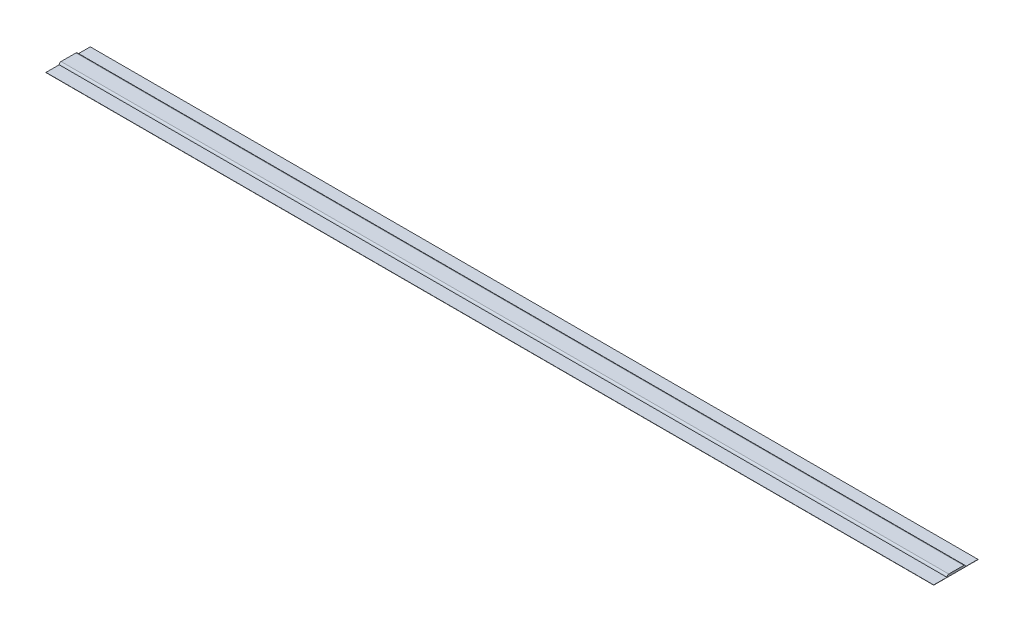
ISO-10303-21;
HEADER;
FILE_DESCRIPTION(('STEP AP214'),'2;1');
FILE_NAME('part.step','',(''),(''),'','','');
FILE_SCHEMA(('AUTOMOTIVE_DESIGN { 1 0 10303 214 1 1 1 1 }'));
ENDSEC;
DATA;
#1=APPLICATION_CONTEXT('core data for automotive mechanical design processes');
#2=APPLICATION_PROTOCOL_DEFINITION('international standard','automotive_design',2000,#1);
#3=PRODUCT_CONTEXT('',#1,'mechanical');
#4=PRODUCT('Part','Part','',(#3));
#5=PRODUCT_RELATED_PRODUCT_CATEGORY('part','',(#4));
#6=PRODUCT_DEFINITION_FORMATION('','',#4);
#7=PRODUCT_DEFINITION_CONTEXT('part definition',#1,'design');
#8=PRODUCT_DEFINITION('design','',#6,#7);
#9=PRODUCT_DEFINITION_SHAPE('','',#8);
#10=(LENGTH_UNIT() NAMED_UNIT(*) SI_UNIT(.MILLI.,.METRE.));
#11=(NAMED_UNIT(*) PLANE_ANGLE_UNIT() SI_UNIT($,.RADIAN.));
#12=(NAMED_UNIT(*) SI_UNIT($,.STERADIAN.) SOLID_ANGLE_UNIT());
#13=UNCERTAINTY_MEASURE_WITH_UNIT(LENGTH_MEASURE(1.E-05),#10,'distance_accuracy_value','');
#14=(GEOMETRIC_REPRESENTATION_CONTEXT(3) GLOBAL_UNCERTAINTY_ASSIGNED_CONTEXT((#13)) GLOBAL_UNIT_ASSIGNED_CONTEXT((#10,
#11,#12)) REPRESENTATION_CONTEXT('',''));
#15=CARTESIAN_POINT('',(0.,0.,0.));
#16=DIRECTION('',(0.,0.,1.));
#17=DIRECTION('',(1.,0.,0.));
#18=AXIS2_PLACEMENT_3D('',#15,#16,#17);
#19=CARTESIAN_POINT('',(-477.393,0.254,23.8125));
#20=DIRECTION('',(0.,1.,0.));
#21=DIRECTION('',(0.,0.,1.));
#22=AXIS2_PLACEMENT_3D('',#19,#20,#21);
#23=PLANE('',#22);
#24=DIRECTION('',(0.,0.,1.));
#25=VECTOR('',#24,1.);
#26=CARTESIAN_POINT('',(-477.393,0.254,-23.8125));
#27=LINE('',#26,#25);
#28=CARTESIAN_POINT('',(-477.393,0.254,-23.8125));
#29=VERTEX_POINT('',#28);
#30=CARTESIAN_POINT('',(-477.393,0.254,-10.412000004));
#31=VERTEX_POINT('',#30);
#32=EDGE_CURVE('E129',#29,#31,#27,.T.);
#33=ORIENTED_EDGE('',*,*,#32,.T.);
#34=DIRECTION('',(1.,0.,0.));
#35=VECTOR('',#34,1.);
#36=CARTESIAN_POINT('',(-477.393,0.254,-10.412000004));
#37=LINE('',#36,#35);
#38=CARTESIAN_POINT('',(477.393,0.254,-10.412000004));
#39=VERTEX_POINT('',#38);
#40=EDGE_CURVE('E117',#31,#39,#37,.T.);
#41=ORIENTED_EDGE('',*,*,#40,.T.);
#42=DIRECTION('',(0.,0.,-1.));
#43=VECTOR('',#42,1.);
#44=CARTESIAN_POINT('',(477.393,0.254,-23.8125));
#45=LINE('',#44,#43);
#46=CARTESIAN_POINT('',(477.393,0.254,-23.8125));
#47=VERTEX_POINT('',#46);
#48=EDGE_CURVE('E142',#39,#47,#45,.T.);
#49=ORIENTED_EDGE('',*,*,#48,.T.);
#50=DIRECTION('',(-1.,0.,0.));
#51=VECTOR('',#50,1.);
#52=CARTESIAN_POINT('',(-477.393,0.254,-23.8125));
#53=LINE('',#52,#51);
#54=EDGE_CURVE('E67',#47,#29,#53,.T.);
#55=ORIENTED_EDGE('',*,*,#54,.T.);
#56=EDGE_LOOP('',(#33,#41,#49,#55));
#57=FACE_BOUND('',#56,.T.);
#58=ADVANCED_FACE('F42',(#57),#23,.T.);
#59=CARTESIAN_POINT('',(-477.393,0.254,-23.8125));
#60=DIRECTION('',(1.,0.,0.));
#61=DIRECTION('',(0.,0.,-1.));
#62=AXIS2_PLACEMENT_3D('',#59,#60,#61);
#63=PLANE('',#62);
#64=DIRECTION('',(0.,0.,1.));
#65=VECTOR('',#64,1.);
#66=CARTESIAN_POINT('',(-477.393,0.,-23.8125));
#67=LINE('',#66,#65);
#68=CARTESIAN_POINT('',(-477.393,0.,-23.8125));
#69=VERTEX_POINT('',#68);
#70=CARTESIAN_POINT('',(-477.393,0.,23.8125));
#71=VERTEX_POINT('',#70);
#72=EDGE_CURVE('E153',#69,#71,#67,.T.);
#73=ORIENTED_EDGE('',*,*,#72,.T.);
#74=DIRECTION('',(0.,-1.,0.));
#75=VECTOR('',#74,1.);
#76=CARTESIAN_POINT('',(-477.393,0.254,23.8125));
#77=LINE('',#76,#75);
#78=CARTESIAN_POINT('',(-477.393,0.254,23.8125));
#79=VERTEX_POINT('',#78);
#80=EDGE_CURVE('E11',#79,#71,#77,.T.);
#81=ORIENTED_EDGE('',*,*,#80,.F.);
#82=CARTESIAN_POINT('',(-477.393,0.254,9.652));
#83=VERTEX_POINT('',#82);
#84=EDGE_CURVE('E96',#83,#79,#27,.T.);
#85=ORIENTED_EDGE('',*,*,#84,.F.);
#86=CARTESIAN_POINT('',(-477.393,0.254,7.62));
#87=DIRECTION('',(1.,0.,0.));
#88=DIRECTION('',(0.,0.,-1.));
#89=AXIS2_PLACEMENT_3D('',#86,#87,#88);
#90=CIRCLE('',#89,2.032);
#91=CARTESIAN_POINT('',(-477.393,2.286,7.62));
#92=VERTEX_POINT('',#91);
#93=EDGE_CURVE('E124',#92,#83,#90,.T.);
#94=ORIENTED_EDGE('',*,*,#93,.F.);
#95=DIRECTION('',(0.,0.,-1.));
#96=VECTOR('',#95,1.);
#97=CARTESIAN_POINT('',(-477.393,2.286,0.));
#98=LINE('',#97,#96);
#99=CARTESIAN_POINT('',(-477.393,2.286,-8.380000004));
#100=VERTEX_POINT('',#99);
#101=EDGE_CURVE('E132',#92,#100,#98,.T.);
#102=ORIENTED_EDGE('',*,*,#101,.T.);
#103=CARTESIAN_POINT('',(-477.393,0.254,-8.380000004));
#104=DIRECTION('',(1.,0.,0.));
#105=DIRECTION('',(0.,0.,-1.));
#106=AXIS2_PLACEMENT_3D('',#103,#104,#105);
#107=CIRCLE('',#106,2.032);
#108=EDGE_CURVE('E120',#31,#100,#107,.T.);
#109=ORIENTED_EDGE('',*,*,#108,.F.);
#110=ORIENTED_EDGE('',*,*,#32,.F.);
#111=DIRECTION('',(0.,-1.,0.));
#112=VECTOR('',#111,1.);
#113=CARTESIAN_POINT('',(-477.393,0.254,-23.8125));
#114=LINE('',#113,#112);
#115=EDGE_CURVE('E152',#29,#69,#114,.T.);
#116=ORIENTED_EDGE('',*,*,#115,.T.);
#117=EDGE_LOOP('',(#73,#81,#85,#94,#102,#109,#110,#116));
#118=FACE_BOUND('',#117,.T.);
#119=ADVANCED_FACE('F44',(#118),#63,.F.);
#120=CARTESIAN_POINT('',(-477.393,0.254,23.8125));
#121=DIRECTION('',(0.,0.,-1.));
#122=DIRECTION('',(-1.,0.,0.));
#123=AXIS2_PLACEMENT_3D('',#120,#121,#122);
#124=PLANE('',#123);
#125=DIRECTION('',(1.,0.,0.));
#126=VECTOR('',#125,1.);
#127=CARTESIAN_POINT('',(-477.393,0.,23.8125));
#128=LINE('',#127,#126);
#129=CARTESIAN_POINT('',(477.393,0.,23.8125));
#130=VERTEX_POINT('',#129);
#131=EDGE_CURVE('E156',#71,#130,#128,.T.);
#132=ORIENTED_EDGE('',*,*,#131,.T.);
#133=DIRECTION('',(0.,-1.,0.));
#134=VECTOR('',#133,1.);
#135=CARTESIAN_POINT('',(477.393,0.254,23.8125));
#136=LINE('',#135,#134);
#137=CARTESIAN_POINT('',(477.393,0.254,23.8125));
#138=VERTEX_POINT('',#137);
#139=EDGE_CURVE('E51',#138,#130,#136,.T.);
#140=ORIENTED_EDGE('',*,*,#139,.F.);
#141=DIRECTION('',(1.,0.,0.));
#142=VECTOR('',#141,1.);
#143=CARTESIAN_POINT('',(-477.393,0.254,23.8125));
#144=LINE('',#143,#142);
#145=EDGE_CURVE('E138',#79,#138,#144,.T.);
#146=ORIENTED_EDGE('',*,*,#145,.F.);
#147=ORIENTED_EDGE('',*,*,#80,.T.);
#148=EDGE_LOOP('',(#132,#140,#146,#147));
#149=FACE_BOUND('',#148,.T.);
#150=ADVANCED_FACE('F208',(#149),#124,.F.);
#151=CARTESIAN_POINT('',(477.393,0.254,-23.8125));
#152=DIRECTION('',(-1.,0.,0.));
#153=DIRECTION('',(0.,0.,1.));
#154=AXIS2_PLACEMENT_3D('',#151,#152,#153);
#155=PLANE('',#154);
#156=DIRECTION('',(0.,0.,-1.));
#157=VECTOR('',#156,1.);
#158=CARTESIAN_POINT('',(477.393,0.,-23.8125));
#159=LINE('',#158,#157);
#160=CARTESIAN_POINT('',(477.393,0.,-23.8125));
#161=VERTEX_POINT('',#160);
#162=EDGE_CURVE('E160',#130,#161,#159,.T.);
#163=ORIENTED_EDGE('',*,*,#162,.T.);
#164=DIRECTION('',(0.,-1.,0.));
#165=VECTOR('',#164,1.);
#166=CARTESIAN_POINT('',(477.393,0.254,-23.8125));
#167=LINE('',#166,#165);
#168=EDGE_CURVE('E167',#47,#161,#167,.T.);
#169=ORIENTED_EDGE('',*,*,#168,.F.);
#170=ORIENTED_EDGE('',*,*,#48,.F.);
#171=CARTESIAN_POINT('',(477.393,0.254,-8.380000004));
#172=DIRECTION('',(1.,0.,0.));
#173=DIRECTION('',(0.,0.,-1.));
#174=AXIS2_PLACEMENT_3D('',#171,#172,#173);
#175=CIRCLE('',#174,2.032);
#176=CARTESIAN_POINT('',(477.393,2.286,-8.380000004));
#177=VERTEX_POINT('',#176);
#178=EDGE_CURVE('E58',#39,#177,#175,.T.);
#179=ORIENTED_EDGE('',*,*,#178,.T.);
#180=DIRECTION('',(0.,0.,-1.));
#181=VECTOR('',#180,1.);
#182=CARTESIAN_POINT('',(477.393,2.286,0.));
#183=LINE('',#182,#181);
#184=CARTESIAN_POINT('',(477.393,2.286,7.62));
#185=VERTEX_POINT('',#184);
#186=EDGE_CURVE('E187',#185,#177,#183,.T.);
#187=ORIENTED_EDGE('',*,*,#186,.F.);
#188=CARTESIAN_POINT('',(477.393,0.254,7.62));
#189=DIRECTION('',(1.,0.,0.));
#190=DIRECTION('',(0.,0.,-1.));
#191=AXIS2_PLACEMENT_3D('',#188,#189,#190);
#192=CIRCLE('',#191,2.032);
#193=CARTESIAN_POINT('',(477.393,0.254,9.652));
#194=VERTEX_POINT('',#193);
#195=EDGE_CURVE('E135',#185,#194,#192,.T.);
#196=ORIENTED_EDGE('',*,*,#195,.T.);
#197=EDGE_CURVE('E146',#138,#194,#45,.T.);
#198=ORIENTED_EDGE('',*,*,#197,.F.);
#199=ORIENTED_EDGE('',*,*,#139,.T.);
#200=EDGE_LOOP('',(#163,#169,#170,#179,#187,#196,#198,#199));
#201=FACE_BOUND('',#200,.T.);
#202=ADVANCED_FACE('F175',(#201),#155,.F.);
#203=CARTESIAN_POINT('',(-477.393,0.254,-23.8125));
#204=DIRECTION('',(0.,0.,1.));
#205=DIRECTION('',(1.,0.,0.));
#206=AXIS2_PLACEMENT_3D('',#203,#204,#205);
#207=PLANE('',#206);
#208=DIRECTION('',(-1.,0.,0.));
#209=VECTOR('',#208,1.);
#210=CARTESIAN_POINT('',(-477.393,0.,-23.8125));
#211=LINE('',#210,#209);
#212=EDGE_CURVE('E88',#161,#69,#211,.T.);
#213=ORIENTED_EDGE('',*,*,#212,.T.);
#214=ORIENTED_EDGE('',*,*,#115,.F.);
#215=ORIENTED_EDGE('',*,*,#54,.F.);
#216=ORIENTED_EDGE('',*,*,#168,.T.);
#217=EDGE_LOOP('',(#213,#214,#215,#216));
#218=FACE_BOUND('',#217,.T.);
#219=ADVANCED_FACE('F183',(#218),#207,.F.);
#220=DIRECTION('',(1.,0.,0.));
#221=VECTOR('',#220,1.);
#222=CARTESIAN_POINT('',(-477.393,0.254,9.652));
#223=LINE('',#222,#221);
#224=EDGE_CURVE('E157',#83,#194,#223,.T.);
#225=ORIENTED_EDGE('',*,*,#224,.F.);
#226=ORIENTED_EDGE('',*,*,#84,.T.);
#227=ORIENTED_EDGE('',*,*,#145,.T.);
#228=ORIENTED_EDGE('',*,*,#197,.T.);
#229=EDGE_LOOP('',(#225,#226,#227,#228));
#230=FACE_BOUND('',#229,.T.);
#231=ADVANCED_FACE('F207',(#230),#23,.T.);
#232=CARTESIAN_POINT('',(-477.393,0.,23.8125));
#233=DIRECTION('',(0.,1.,0.));
#234=DIRECTION('',(0.,0.,1.));
#235=AXIS2_PLACEMENT_3D('',#232,#233,#234);
#236=PLANE('',#235);
#237=ORIENTED_EDGE('',*,*,#72,.F.);
#238=ORIENTED_EDGE('',*,*,#212,.F.);
#239=ORIENTED_EDGE('',*,*,#162,.F.);
#240=ORIENTED_EDGE('',*,*,#131,.F.);
#241=EDGE_LOOP('',(#237,#238,#239,#240));
#242=FACE_BOUND('',#241,.T.);
#243=ADVANCED_FACE('F181',(#242),#236,.F.);
#244=CARTESIAN_POINT('',(-477.393,0.254,7.62));
#245=DIRECTION('',(1.,0.,0.));
#246=DIRECTION('',(0.,0.,-1.));
#247=AXIS2_PLACEMENT_3D('',#244,#245,#246);
#248=CYLINDRICAL_SURFACE('',#247,2.032);
#249=ORIENTED_EDGE('',*,*,#195,.F.);
#250=DIRECTION('',(1.,0.,0.));
#251=VECTOR('',#250,1.);
#252=CARTESIAN_POINT('',(-477.393,2.286,7.62));
#253=LINE('',#252,#251);
#254=EDGE_CURVE('E200',#92,#185,#253,.T.);
#255=ORIENTED_EDGE('',*,*,#254,.F.);
#256=ORIENTED_EDGE('',*,*,#93,.T.);
#257=ORIENTED_EDGE('',*,*,#224,.T.);
#258=EDGE_LOOP('',(#249,#255,#256,#257));
#259=FACE_BOUND('',#258,.T.);
#260=ADVANCED_FACE('F206',(#259),#248,.T.);
#261=CARTESIAN_POINT('',(-477.393,2.286,0.));
#262=DIRECTION('',(0.,-1.,0.));
#263=DIRECTION('',(0.,0.,-1.));
#264=AXIS2_PLACEMENT_3D('',#261,#262,#263);
#265=PLANE('',#264);
#266=ORIENTED_EDGE('',*,*,#186,.T.);
#267=DIRECTION('',(1.,0.,0.));
#268=VECTOR('',#267,1.);
#269=CARTESIAN_POINT('',(-477.393,2.286,-8.380000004));
#270=LINE('',#269,#268);
#271=EDGE_CURVE('E123',#100,#177,#270,.T.);
#272=ORIENTED_EDGE('',*,*,#271,.F.);
#273=ORIENTED_EDGE('',*,*,#101,.F.);
#274=ORIENTED_EDGE('',*,*,#254,.T.);
#275=EDGE_LOOP('',(#266,#272,#273,#274));
#276=FACE_BOUND('',#275,.T.);
#277=ADVANCED_FACE('F204',(#276),#265,.F.);
#278=CARTESIAN_POINT('',(-477.393,0.254,-8.380000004));
#279=DIRECTION('',(1.,0.,0.));
#280=DIRECTION('',(0.,0.,-1.));
#281=AXIS2_PLACEMENT_3D('',#278,#279,#280);
#282=CYLINDRICAL_SURFACE('',#281,2.032);
#283=ORIENTED_EDGE('',*,*,#178,.F.);
#284=ORIENTED_EDGE('',*,*,#40,.F.);
#285=ORIENTED_EDGE('',*,*,#108,.T.);
#286=ORIENTED_EDGE('',*,*,#271,.T.);
#287=EDGE_LOOP('',(#283,#284,#285,#286));
#288=FACE_BOUND('',#287,.T.);
#289=ADVANCED_FACE('F119',(#288),#282,.T.);
#290=CLOSED_SHELL('',(#58,#119,#150,#202,#219,#231,#243,#260,#277,#289));
#291=MANIFOLD_SOLID_BREP('B2',#290);
#292=ADVANCED_BREP_SHAPE_REPRESENTATION('',(#18,#291),#14);
#293=SHAPE_DEFINITION_REPRESENTATION(#9,#292);
ENDSEC;
END-ISO-10303-21;
